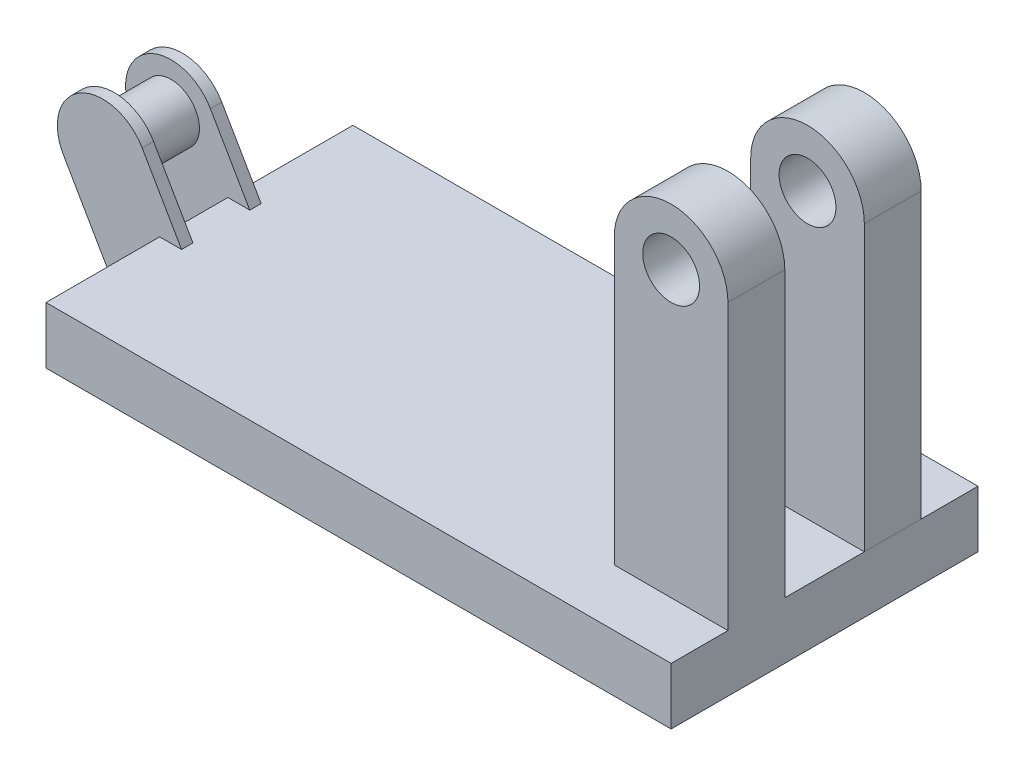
ISO-10303-21;
HEADER;
FILE_DESCRIPTION(('STEP AP214'),'2;1');
FILE_NAME('part.step','',(''),(''),'','','');
FILE_SCHEMA(('AUTOMOTIVE_DESIGN { 1 0 10303 214 1 1 1 1 }'));
ENDSEC;
DATA;
#1=APPLICATION_CONTEXT('core data for automotive mechanical design processes');
#2=APPLICATION_PROTOCOL_DEFINITION('international standard','automotive_design',2000,#1);
#3=PRODUCT_CONTEXT('',#1,'mechanical');
#4=PRODUCT('Part','Part','',(#3));
#5=PRODUCT_RELATED_PRODUCT_CATEGORY('part','',(#4));
#6=PRODUCT_DEFINITION_FORMATION('','',#4);
#7=PRODUCT_DEFINITION_CONTEXT('part definition',#1,'design');
#8=PRODUCT_DEFINITION('design','',#6,#7);
#9=PRODUCT_DEFINITION_SHAPE('','',#8);
#10=(LENGTH_UNIT() NAMED_UNIT(*) SI_UNIT(.MILLI.,.METRE.));
#11=(NAMED_UNIT(*) PLANE_ANGLE_UNIT() SI_UNIT($,.RADIAN.));
#12=(NAMED_UNIT(*) SI_UNIT($,.STERADIAN.) SOLID_ANGLE_UNIT());
#13=UNCERTAINTY_MEASURE_WITH_UNIT(LENGTH_MEASURE(1.E-05),#10,'distance_accuracy_value','');
#14=(GEOMETRIC_REPRESENTATION_CONTEXT(3) GLOBAL_UNCERTAINTY_ASSIGNED_CONTEXT((#13)) GLOBAL_UNIT_ASSIGNED_CONTEXT((#10,
#11,#12)) REPRESENTATION_CONTEXT('',''));
#15=CARTESIAN_POINT('',(0.,0.,0.));
#16=DIRECTION('',(0.,0.,1.));
#17=DIRECTION('',(1.,0.,0.));
#18=AXIS2_PLACEMENT_3D('',#15,#16,#17);
#19=CARTESIAN_POINT('',(225.,300.,-85.));
#20=DIRECTION('',(0.,0.,-1.));
#21=DIRECTION('',(1.,0.,0.));
#22=AXIS2_PLACEMENT_3D('',#19,#20,#21);
#23=PLANE('',#22);
#24=DIRECTION('',(1.,0.,0.));
#25=VECTOR('',#24,1.);
#26=CARTESIAN_POINT('',(275.,50.,-85.));
#27=LINE('',#26,#25);
#28=CARTESIAN_POINT('',(175.,50.,-85.));
#29=VERTEX_POINT('',#28);
#30=CARTESIAN_POINT('',(275.,50.,-85.));
#31=VERTEX_POINT('',#30);
#32=EDGE_CURVE('E96',#29,#31,#27,.T.);
#33=ORIENTED_EDGE('',*,*,#32,.F.);
#34=DIRECTION('',(0.,-1.,0.));
#35=VECTOR('',#34,1.);
#36=CARTESIAN_POINT('',(175.,50.,-85.));
#37=LINE('',#36,#35);
#38=CARTESIAN_POINT('',(175.,300.,-85.));
#39=VERTEX_POINT('',#38);
#40=EDGE_CURVE('E99',#39,#29,#37,.T.);
#41=ORIENTED_EDGE('',*,*,#40,.F.);
#42=CARTESIAN_POINT('',(225.,300.,-85.));
#43=DIRECTION('',(0.,0.,1.));
#44=DIRECTION('',(1.,0.,0.));
#45=AXIS2_PLACEMENT_3D('',#42,#43,#44);
#46=CIRCLE('',#45,50.);
#47=CARTESIAN_POINT('',(275.,300.,-85.));
#48=VERTEX_POINT('',#47);
#49=EDGE_CURVE('E87',#48,#39,#46,.T.);
#50=ORIENTED_EDGE('',*,*,#49,.F.);
#51=DIRECTION('',(0.,1.,0.));
#52=VECTOR('',#51,1.);
#53=CARTESIAN_POINT('',(275.,300.,-85.));
#54=LINE('',#53,#52);
#55=EDGE_CURVE('E92',#31,#48,#54,.T.);
#56=ORIENTED_EDGE('',*,*,#55,.F.);
#57=EDGE_LOOP('',(#33,#41,#50,#56));
#58=FACE_BOUND('',#57,.T.);
#59=CARTESIAN_POINT('',(225.,300.,-85.));
#60=DIRECTION('',(0.,0.,1.));
#61=DIRECTION('',(1.,0.,0.));
#62=AXIS2_PLACEMENT_3D('',#59,#60,#61);
#63=CIRCLE('',#62,25.);
#64=CARTESIAN_POINT('',(250.,300.,-85.));
#65=VERTEX_POINT('',#64);
#66=EDGE_CURVE('E108',#65,#65,#63,.T.);
#67=ORIENTED_EDGE('',*,*,#66,.T.);
#68=EDGE_LOOP('',(#67));
#69=FACE_BOUND('',#68,.T.);
#70=ADVANCED_FACE('F40',(#58,#69),#23,.T.);
#71=CARTESIAN_POINT('',(225.,300.,-35.));
#72=DIRECTION('',(0.,0.,-1.));
#73=DIRECTION('',(1.,0.,0.));
#74=AXIS2_PLACEMENT_3D('',#71,#72,#73);
#75=PLANE('',#74);
#76=DIRECTION('',(1.,0.,0.));
#77=VECTOR('',#76,1.);
#78=CARTESIAN_POINT('',(275.,50.,-35.));
#79=LINE('',#78,#77);
#80=CARTESIAN_POINT('',(175.,50.,-35.));
#81=VERTEX_POINT('',#80);
#82=CARTESIAN_POINT('',(275.,50.,-35.));
#83=VERTEX_POINT('',#82);
#84=EDGE_CURVE('E104',#81,#83,#79,.T.);
#85=ORIENTED_EDGE('',*,*,#84,.T.);
#86=DIRECTION('',(0.,1.,0.));
#87=VECTOR('',#86,1.);
#88=CARTESIAN_POINT('',(275.,300.,-35.));
#89=LINE('',#88,#87);
#90=CARTESIAN_POINT('',(275.,300.,-35.));
#91=VERTEX_POINT('',#90);
#92=EDGE_CURVE('E107',#83,#91,#89,.T.);
#93=ORIENTED_EDGE('',*,*,#92,.T.);
#94=CARTESIAN_POINT('',(225.,300.,-35.));
#95=DIRECTION('',(0.,0.,1.));
#96=DIRECTION('',(1.,0.,0.));
#97=AXIS2_PLACEMENT_3D('',#94,#95,#96);
#98=CIRCLE('',#97,50.);
#99=CARTESIAN_POINT('',(175.,300.,-35.));
#100=VERTEX_POINT('',#99);
#101=EDGE_CURVE('E90',#91,#100,#98,.T.);
#102=ORIENTED_EDGE('',*,*,#101,.T.);
#103=DIRECTION('',(0.,-1.,0.));
#104=VECTOR('',#103,1.);
#105=CARTESIAN_POINT('',(175.,50.,-35.));
#106=LINE('',#105,#104);
#107=EDGE_CURVE('E111',#100,#81,#106,.T.);
#108=ORIENTED_EDGE('',*,*,#107,.T.);
#109=EDGE_LOOP('',(#85,#93,#102,#108));
#110=FACE_BOUND('',#109,.T.);
#111=CARTESIAN_POINT('',(225.,300.,-35.));
#112=DIRECTION('',(0.,0.,1.));
#113=DIRECTION('',(1.,0.,0.));
#114=AXIS2_PLACEMENT_3D('',#111,#112,#113);
#115=CIRCLE('',#114,25.);
#116=CARTESIAN_POINT('',(250.,300.,-35.));
#117=VERTEX_POINT('',#116);
#118=EDGE_CURVE('E116',#117,#117,#115,.T.);
#119=ORIENTED_EDGE('',*,*,#118,.F.);
#120=EDGE_LOOP('',(#119));
#121=FACE_BOUND('',#120,.T.);
#122=ADVANCED_FACE('F129',(#110,#121),#75,.F.);
#123=CARTESIAN_POINT('',(275.,50.,-85.));
#124=DIRECTION('',(0.,1.,0.));
#125=DIRECTION('',(0.,0.,-1.));
#126=AXIS2_PLACEMENT_3D('',#123,#124,#125);
#127=PLANE('',#126);
#128=ORIENTED_EDGE('',*,*,#84,.F.);
#129=DIRECTION('',(0.,0.,1.));
#130=VECTOR('',#129,1.);
#131=CARTESIAN_POINT('',(175.,50.,-85.));
#132=LINE('',#131,#130);
#133=EDGE_CURVE('E57',#29,#81,#132,.T.);
#134=ORIENTED_EDGE('',*,*,#133,.F.);
#135=ORIENTED_EDGE('',*,*,#32,.T.);
#136=DIRECTION('',(0.,0.,1.));
#137=VECTOR('',#136,1.);
#138=CARTESIAN_POINT('',(275.,50.,-85.));
#139=LINE('',#138,#137);
#140=EDGE_CURVE('E12',#31,#83,#139,.T.);
#141=ORIENTED_EDGE('',*,*,#140,.T.);
#142=EDGE_LOOP('',(#128,#134,#135,#141));
#143=FACE_BOUND('',#142,.T.);
#144=ADVANCED_FACE('F42',(#143),#127,.F.);
#145=CARTESIAN_POINT('',(275.,300.,-85.));
#146=DIRECTION('',(-1.,0.,0.));
#147=DIRECTION('',(0.,-1.,0.));
#148=AXIS2_PLACEMENT_3D('',#145,#146,#147);
#149=PLANE('',#148);
#150=ORIENTED_EDGE('',*,*,#92,.F.);
#151=ORIENTED_EDGE('',*,*,#140,.F.);
#152=ORIENTED_EDGE('',*,*,#55,.T.);
#153=DIRECTION('',(0.,0.,1.));
#154=VECTOR('',#153,1.);
#155=CARTESIAN_POINT('',(275.,300.,-85.));
#156=LINE('',#155,#154);
#157=EDGE_CURVE('E49',#48,#91,#156,.T.);
#158=ORIENTED_EDGE('',*,*,#157,.T.);
#159=EDGE_LOOP('',(#150,#151,#152,#158));
#160=FACE_BOUND('',#159,.T.);
#161=ADVANCED_FACE('F93',(#160),#149,.F.);
#162=CARTESIAN_POINT('',(225.,300.,-85.));
#163=DIRECTION('',(0.,0.,1.));
#164=DIRECTION('',(-1.,0.,0.));
#165=AXIS2_PLACEMENT_3D('',#162,#163,#164);
#166=CYLINDRICAL_SURFACE('',#165,50.);
#167=ORIENTED_EDGE('',*,*,#101,.F.);
#168=ORIENTED_EDGE('',*,*,#157,.F.);
#169=ORIENTED_EDGE('',*,*,#49,.T.);
#170=DIRECTION('',(0.,0.,1.));
#171=VECTOR('',#170,1.);
#172=CARTESIAN_POINT('',(175.,300.,-85.));
#173=LINE('',#172,#171);
#174=EDGE_CURVE('E73',#39,#100,#173,.T.);
#175=ORIENTED_EDGE('',*,*,#174,.T.);
#176=EDGE_LOOP('',(#167,#168,#169,#175));
#177=FACE_BOUND('',#176,.T.);
#178=ADVANCED_FACE('F85',(#177),#166,.T.);
#179=CARTESIAN_POINT('',(175.,50.,-85.));
#180=DIRECTION('',(1.,0.,0.));
#181=DIRECTION('',(0.,0.,1.));
#182=AXIS2_PLACEMENT_3D('',#179,#180,#181);
#183=PLANE('',#182);
#184=ORIENTED_EDGE('',*,*,#107,.F.);
#185=ORIENTED_EDGE('',*,*,#174,.F.);
#186=ORIENTED_EDGE('',*,*,#40,.T.);
#187=ORIENTED_EDGE('',*,*,#133,.T.);
#188=EDGE_LOOP('',(#184,#185,#186,#187));
#189=FACE_BOUND('',#188,.T.);
#190=ADVANCED_FACE('F125',(#189),#183,.F.);
#191=CARTESIAN_POINT('',(225.,300.,-85.));
#192=DIRECTION('',(0.,0.,1.));
#193=DIRECTION('',(-1.,0.,0.));
#194=AXIS2_PLACEMENT_3D('',#191,#192,#193);
#195=CYLINDRICAL_SURFACE('',#194,25.);
#196=ORIENTED_EDGE('',*,*,#66,.F.);
#197=EDGE_LOOP('',(#196));
#198=FACE_BOUND('',#197,.T.);
#199=ORIENTED_EDGE('',*,*,#118,.T.);
#200=EDGE_LOOP('',(#199));
#201=FACE_BOUND('',#200,.T.);
#202=ADVANCED_FACE('F122',(#198,#201),#195,.F.);
#203=CLOSED_SHELL('',(#70,#122,#144,#161,#178,#190,#202));
#204=MANIFOLD_SOLID_BREP('B2',#203);
#205=CARTESIAN_POINT('',(-275.,50.,-135.));
#206=DIRECTION('',(1.,0.,0.));
#207=DIRECTION('',(0.,0.,-1.));
#208=AXIS2_PLACEMENT_3D('',#205,#206,#207);
#209=PLANE('',#208);
#210=DIRECTION('',(0.,1.,0.));
#211=VECTOR('',#210,1.);
#212=CARTESIAN_POINT('',(-275.,50.,-25.));
#213=LINE('',#212,#211);
#214=CARTESIAN_POINT('',(-275.,0.,-25.));
#215=VERTEX_POINT('',#214);
#216=CARTESIAN_POINT('',(-275.,50.,-25.));
#217=VERTEX_POINT('',#216);
#218=EDGE_CURVE('E199',#215,#217,#213,.T.);
#219=ORIENTED_EDGE('',*,*,#218,.F.);
#220=DIRECTION('',(0.,0.,1.));
#221=VECTOR('',#220,1.);
#222=CARTESIAN_POINT('',(-275.,0.,-135.));
#223=LINE('',#222,#221);
#224=CARTESIAN_POINT('',(-275.,0.,25.));
#225=VERTEX_POINT('',#224);
#226=EDGE_CURVE('E468',#215,#225,#223,.T.);
#227=ORIENTED_EDGE('',*,*,#226,.T.);
#228=DIRECTION('',(0.,-1.,0.));
#229=VECTOR('',#228,1.);
#230=CARTESIAN_POINT('',(-275.,50.,25.));
#231=LINE('',#230,#229);
#232=CARTESIAN_POINT('',(-275.,50.,25.));
#233=VERTEX_POINT('',#232);
#234=EDGE_CURVE('E442',#233,#225,#231,.T.);
#235=ORIENTED_EDGE('',*,*,#234,.F.);
#236=DIRECTION('',(0.,0.,1.));
#237=VECTOR('',#236,1.);
#238=CARTESIAN_POINT('',(-275.,50.,-135.));
#239=LINE('',#238,#237);
#240=EDGE_CURVE('E455',#217,#233,#239,.T.);
#241=ORIENTED_EDGE('',*,*,#240,.F.);
#242=EDGE_LOOP('',(#219,#227,#235,#241));
#243=FACE_BOUND('',#242,.T.);
#244=ADVANCED_FACE('F184',(#243),#209,.F.);
#245=CARTESIAN_POINT('',(-325.,90.,25.));
#246=DIRECTION('',(0.,0.,1.));
#247=DIRECTION('',(1.,0.,0.));
#248=AXIS2_PLACEMENT_3D('',#245,#246,#247);
#249=PLANE('',#248);
#250=DIRECTION('',(1.,0.,0.));
#251=VECTOR('',#250,1.);
#252=CARTESIAN_POINT('',(-275.,50.,25.));
#253=LINE('',#252,#251);
#254=CARTESIAN_POINT('',(-255.717967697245,50.,25.));
#255=VERTEX_POINT('',#254);
#256=EDGE_CURVE('E439',#233,#255,#253,.T.);
#257=ORIENTED_EDGE('',*,*,#256,.F.);
#258=ORIENTED_EDGE('',*,*,#234,.T.);
#259=DIRECTION('',(1.,0.,0.));
#260=VECTOR('',#259,1.);
#261=CARTESIAN_POINT('',(-275.,0.,25.));
#262=LINE('',#261,#260);
#263=CARTESIAN_POINT('',(-319.210884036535,0.,25.));
#264=VERTEX_POINT('',#263);
#265=EDGE_CURVE('E413',#264,#225,#262,.T.);
#266=ORIENTED_EDGE('',*,*,#265,.F.);
#267=DIRECTION('',(0.499999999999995,-0.866025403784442,0.));
#268=VECTOR('',#267,1.);
#269=CARTESIAN_POINT('',(-319.210884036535,0.,25.));
#270=LINE('',#269,#268);
#271=CARTESIAN_POINT('',(-359.109321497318,69.1061208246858,25.));
#272=VERTEX_POINT('',#271);
#273=EDGE_CURVE('E424',#272,#264,#270,.T.);
#274=ORIENTED_EDGE('',*,*,#273,.F.);
#275=CARTESIAN_POINT('',(-325.,90.,25.));
#276=DIRECTION('',(0.,0.,1.));
#277=DIRECTION('',(1.,0.,0.));
#278=AXIS2_PLACEMENT_3D('',#275,#276,#277);
#279=CIRCLE('',#278,40.);
#280=CARTESIAN_POINT('',(-290.358983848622,110.,25.));
#281=VERTEX_POINT('',#280);
#282=EDGE_CURVE('E422',#281,#272,#279,.T.);
#283=ORIENTED_EDGE('',*,*,#282,.F.);
#284=DIRECTION('',(-0.499999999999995,0.866025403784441,0.));
#285=VECTOR('',#284,1.);
#286=CARTESIAN_POINT('',(-290.358983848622,110.,25.));
#287=LINE('',#286,#285);
#288=EDGE_CURVE('E409',#255,#281,#287,.T.);
#289=ORIENTED_EDGE('',*,*,#288,.F.);
#290=EDGE_LOOP('',(#257,#258,#266,#274,#283,#289));
#291=FACE_BOUND('',#290,.T.);
#292=CARTESIAN_POINT('',(-325.,90.,25.));
#293=DIRECTION('',(0.,0.,1.));
#294=DIRECTION('',(1.,0.,0.));
#295=AXIS2_PLACEMENT_3D('',#292,#293,#294);
#296=CIRCLE('',#295,25.);
#297=CARTESIAN_POINT('',(-300.,90.,25.));
#298=VERTEX_POINT('',#297);
#299=EDGE_CURVE('E38',#298,#298,#296,.F.);
#300=ORIENTED_EDGE('',*,*,#299,.F.);
#301=EDGE_LOOP('',(#300));
#302=FACE_BOUND('',#301,.T.);
#303=ADVANCED_FACE('F540',(#291,#302),#249,.F.);
#304=CARTESIAN_POINT('',(-275.,0.,-135.));
#305=VERTEX_POINT('',#304);
#306=CARTESIAN_POINT('',(-275.,0.,-35.));
#307=VERTEX_POINT('',#306);
#308=EDGE_CURVE('E465',#305,#307,#223,.T.);
#309=ORIENTED_EDGE('',*,*,#308,.T.);
#310=DIRECTION('',(0.,1.,0.));
#311=VECTOR('',#310,1.);
#312=CARTESIAN_POINT('',(-275.,50.,-35.));
#313=LINE('',#312,#311);
#314=CARTESIAN_POINT('',(-275.,50.,-35.));
#315=VERTEX_POINT('',#314);
#316=EDGE_CURVE('E330',#307,#315,#313,.T.);
#317=ORIENTED_EDGE('',*,*,#316,.T.);
#318=CARTESIAN_POINT('',(-275.,50.,-135.));
#319=VERTEX_POINT('',#318);
#320=EDGE_CURVE('E451',#319,#315,#239,.T.);
#321=ORIENTED_EDGE('',*,*,#320,.F.);
#322=DIRECTION('',(0.,-1.,0.));
#323=VECTOR('',#322,1.);
#324=CARTESIAN_POINT('',(-275.,50.,-135.));
#325=LINE('',#324,#323);
#326=EDGE_CURVE('E464',#319,#305,#325,.T.);
#327=ORIENTED_EDGE('',*,*,#326,.T.);
#328=EDGE_LOOP('',(#309,#317,#321,#327));
#329=FACE_BOUND('',#328,.T.);
#330=ADVANCED_FACE('F542',(#329),#209,.F.);
#331=CARTESIAN_POINT('',(-275.,50.,35.));
#332=VERTEX_POINT('',#331);
#333=CARTESIAN_POINT('',(-275.,50.,135.));
#334=VERTEX_POINT('',#333);
#335=EDGE_CURVE('E456',#332,#334,#239,.T.);
#336=ORIENTED_EDGE('',*,*,#335,.F.);
#337=DIRECTION('',(0.,-1.,0.));
#338=VECTOR('',#337,1.);
#339=CARTESIAN_POINT('',(-275.,50.,35.));
#340=LINE('',#339,#338);
#341=CARTESIAN_POINT('',(-275.,0.,35.));
#342=VERTEX_POINT('',#341);
#343=EDGE_CURVE('E447',#332,#342,#340,.T.);
#344=ORIENTED_EDGE('',*,*,#343,.T.);
#345=CARTESIAN_POINT('',(-275.,0.,135.));
#346=VERTEX_POINT('',#345);
#347=EDGE_CURVE('E450',#342,#346,#223,.T.);
#348=ORIENTED_EDGE('',*,*,#347,.T.);
#349=DIRECTION('',(0.,-1.,0.));
#350=VECTOR('',#349,1.);
#351=CARTESIAN_POINT('',(-275.,50.,135.));
#352=LINE('',#351,#350);
#353=EDGE_CURVE('E192',#334,#346,#352,.T.);
#354=ORIENTED_EDGE('',*,*,#353,.F.);
#355=EDGE_LOOP('',(#336,#344,#348,#354));
#356=FACE_BOUND('',#355,.T.);
#357=ADVANCED_FACE('F186',(#356),#209,.F.);
#358=CARTESIAN_POINT('',(-275.,50.,135.));
#359=DIRECTION('',(0.,0.,-1.));
#360=DIRECTION('',(-1.,0.,0.));
#361=AXIS2_PLACEMENT_3D('',#358,#359,#360);
#362=PLANE('',#361);
#363=DIRECTION('',(1.,0.,0.));
#364=VECTOR('',#363,1.);
#365=CARTESIAN_POINT('',(-275.,0.,135.));
#366=LINE('',#365,#364);
#367=CARTESIAN_POINT('',(275.,0.,135.));
#368=VERTEX_POINT('',#367);
#369=EDGE_CURVE('E467',#346,#368,#366,.T.);
#370=ORIENTED_EDGE('',*,*,#369,.T.);
#371=DIRECTION('',(0.,-1.,0.));
#372=VECTOR('',#371,1.);
#373=CARTESIAN_POINT('',(275.,50.,135.));
#374=LINE('',#373,#372);
#375=CARTESIAN_POINT('',(275.,50.,135.));
#376=VERTEX_POINT('',#375);
#377=EDGE_CURVE('E479',#376,#368,#374,.T.);
#378=ORIENTED_EDGE('',*,*,#377,.F.);
#379=DIRECTION('',(1.,0.,0.));
#380=VECTOR('',#379,1.);
#381=CARTESIAN_POINT('',(-275.,50.,135.));
#382=LINE('',#381,#380);
#383=EDGE_CURVE('E454',#334,#376,#382,.T.);
#384=ORIENTED_EDGE('',*,*,#383,.F.);
#385=ORIENTED_EDGE('',*,*,#353,.T.);
#386=EDGE_LOOP('',(#370,#378,#384,#385));
#387=FACE_BOUND('',#386,.T.);
#388=ADVANCED_FACE('F485',(#387),#362,.F.);
#389=CARTESIAN_POINT('',(275.,50.,-135.));
#390=DIRECTION('',(-1.,0.,0.));
#391=DIRECTION('',(0.,0.,1.));
#392=AXIS2_PLACEMENT_3D('',#389,#390,#391);
#393=PLANE('',#392);
#394=DIRECTION('',(0.,-1.,0.));
#395=VECTOR('',#394,1.);
#396=CARTESIAN_POINT('',(275.,50.,-135.));
#397=LINE('',#396,#395);
#398=CARTESIAN_POINT('',(275.,50.,-135.));
#399=VERTEX_POINT('',#398);
#400=CARTESIAN_POINT('',(275.,0.,-135.));
#401=VERTEX_POINT('',#400);
#402=EDGE_CURVE('E476',#399,#401,#397,.T.);
#403=ORIENTED_EDGE('',*,*,#402,.F.);
#404=DIRECTION('',(0.,0.,-1.));
#405=VECTOR('',#404,1.);
#406=CARTESIAN_POINT('',(275.,50.,-135.));
#407=LINE('',#406,#405);
#408=CARTESIAN_POINT('',(275.,50.,35.));
#409=VERTEX_POINT('',#408);
#410=EDGE_CURVE('E458',#409,#399,#407,.T.);
#411=ORIENTED_EDGE('',*,*,#410,.F.);
#412=DIRECTION('',(0.,1.,0.));
#413=VECTOR('',#412,1.);
#414=CARTESIAN_POINT('',(275.,300.,35.));
#415=LINE('',#414,#413);
#416=CARTESIAN_POINT('',(275.,300.,35.));
#417=VERTEX_POINT('',#416);
#418=EDGE_CURVE('E396',#409,#417,#415,.T.);
#419=ORIENTED_EDGE('',*,*,#418,.T.);
#420=DIRECTION('',(0.,0.,-1.));
#421=VECTOR('',#420,1.);
#422=CARTESIAN_POINT('',(275.,300.,85.));
#423=LINE('',#422,#421);
#424=CARTESIAN_POINT('',(275.,300.,85.));
#425=VERTEX_POINT('',#424);
#426=EDGE_CURVE('E406',#425,#417,#423,.T.);
#427=ORIENTED_EDGE('',*,*,#426,.F.);
#428=DIRECTION('',(0.,1.,0.));
#429=VECTOR('',#428,1.);
#430=CARTESIAN_POINT('',(275.,300.,85.));
#431=LINE('',#430,#429);
#432=CARTESIAN_POINT('',(275.,50.,85.));
#433=VERTEX_POINT('',#432);
#434=EDGE_CURVE('E387',#433,#425,#431,.T.);
#435=ORIENTED_EDGE('',*,*,#434,.F.);
#436=EDGE_CURVE('E459',#376,#433,#407,.T.);
#437=ORIENTED_EDGE('',*,*,#436,.F.);
#438=ORIENTED_EDGE('',*,*,#377,.T.);
#439=DIRECTION('',(0.,0.,-1.));
#440=VECTOR('',#439,1.);
#441=CARTESIAN_POINT('',(275.,0.,-135.));
#442=LINE('',#441,#440);
#443=EDGE_CURVE('E470',#368,#401,#442,.T.);
#444=ORIENTED_EDGE('',*,*,#443,.T.);
#445=EDGE_LOOP('',(#403,#411,#419,#427,#435,#437,#438,#444));
#446=FACE_BOUND('',#445,.T.);
#447=ADVANCED_FACE('F494',(#446),#393,.F.);
#448=CARTESIAN_POINT('',(-275.,50.,-135.));
#449=DIRECTION('',(0.,0.,1.));
#450=DIRECTION('',(1.,0.,0.));
#451=AXIS2_PLACEMENT_3D('',#448,#449,#450);
#452=PLANE('',#451);
#453=DIRECTION('',(-1.,0.,0.));
#454=VECTOR('',#453,1.);
#455=CARTESIAN_POINT('',(-275.,0.,-135.));
#456=LINE('',#455,#454);
#457=EDGE_CURVE('E472',#401,#305,#456,.T.);
#458=ORIENTED_EDGE('',*,*,#457,.T.);
#459=ORIENTED_EDGE('',*,*,#326,.F.);
#460=DIRECTION('',(-1.,0.,0.));
#461=VECTOR('',#460,1.);
#462=CARTESIAN_POINT('',(-275.,50.,-135.));
#463=LINE('',#462,#461);
#464=EDGE_CURVE('E462',#399,#319,#463,.T.);
#465=ORIENTED_EDGE('',*,*,#464,.F.);
#466=ORIENTED_EDGE('',*,*,#402,.T.);
#467=EDGE_LOOP('',(#458,#459,#465,#466));
#468=FACE_BOUND('',#467,.T.);
#469=ADVANCED_FACE('F499',(#468),#452,.F.);
#470=CARTESIAN_POINT('',(-275.,50.,135.));
#471=DIRECTION('',(0.,1.,0.));
#472=DIRECTION('',(0.,0.,1.));
#473=AXIS2_PLACEMENT_3D('',#470,#471,#472);
#474=PLANE('',#473);
#475=DIRECTION('',(-1.,0.,0.));
#476=VECTOR('',#475,1.);
#477=CARTESIAN_POINT('',(-275.,50.,-35.));
#478=LINE('',#477,#476);
#479=CARTESIAN_POINT('',(-255.717967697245,50.,-35.));
#480=VERTEX_POINT('',#479);
#481=EDGE_CURVE('E375',#480,#315,#478,.T.);
#482=ORIENTED_EDGE('',*,*,#481,.F.);
#483=DIRECTION('',(0.,0.,1.));
#484=VECTOR('',#483,1.);
#485=CARTESIAN_POINT('',(-255.717967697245,50.,-35.));
#486=LINE('',#485,#484);
#487=CARTESIAN_POINT('',(-255.717967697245,50.,-25.));
#488=VERTEX_POINT('',#487);
#489=EDGE_CURVE('E356',#480,#488,#486,.T.);
#490=ORIENTED_EDGE('',*,*,#489,.T.);
#491=DIRECTION('',(-1.,0.,0.));
#492=VECTOR('',#491,1.);
#493=CARTESIAN_POINT('',(-275.,50.,-25.));
#494=LINE('',#493,#492);
#495=EDGE_CURVE('E372',#488,#217,#494,.T.);
#496=ORIENTED_EDGE('',*,*,#495,.T.);
#497=ORIENTED_EDGE('',*,*,#240,.T.);
#498=ORIENTED_EDGE('',*,*,#256,.T.);
#499=DIRECTION('',(0.,0.,-1.));
#500=VECTOR('',#499,1.);
#501=CARTESIAN_POINT('',(-255.717967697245,50.,35.));
#502=LINE('',#501,#500);
#503=CARTESIAN_POINT('',(-255.717967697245,50.,35.));
#504=VERTEX_POINT('',#503);
#505=EDGE_CURVE('E436',#504,#255,#502,.T.);
#506=ORIENTED_EDGE('',*,*,#505,.F.);
#507=DIRECTION('',(1.,0.,0.));
#508=VECTOR('',#507,1.);
#509=CARTESIAN_POINT('',(-275.,50.,35.));
#510=LINE('',#509,#508);
#511=EDGE_CURVE('E445',#332,#504,#510,.T.);
#512=ORIENTED_EDGE('',*,*,#511,.F.);
#513=ORIENTED_EDGE('',*,*,#335,.T.);
#514=ORIENTED_EDGE('',*,*,#383,.T.);
#515=ORIENTED_EDGE('',*,*,#436,.T.);
#516=DIRECTION('',(1.,0.,0.));
#517=VECTOR('',#516,1.);
#518=CARTESIAN_POINT('',(275.,50.,85.));
#519=LINE('',#518,#517);
#520=CARTESIAN_POINT('',(175.,50.,85.));
#521=VERTEX_POINT('',#520);
#522=EDGE_CURVE('E384',#521,#433,#519,.T.);
#523=ORIENTED_EDGE('',*,*,#522,.F.);
#524=DIRECTION('',(0.,0.,-1.));
#525=VECTOR('',#524,1.);
#526=CARTESIAN_POINT('',(175.,50.,85.));
#527=LINE('',#526,#525);
#528=CARTESIAN_POINT('',(175.,50.,35.));
#529=VERTEX_POINT('',#528);
#530=EDGE_CURVE('E394',#521,#529,#527,.T.);
#531=ORIENTED_EDGE('',*,*,#530,.T.);
#532=DIRECTION('',(1.,0.,0.));
#533=VECTOR('',#532,1.);
#534=CARTESIAN_POINT('',(275.,50.,35.));
#535=LINE('',#534,#533);
#536=EDGE_CURVE('E207',#529,#409,#535,.T.);
#537=ORIENTED_EDGE('',*,*,#536,.T.);
#538=ORIENTED_EDGE('',*,*,#410,.T.);
#539=ORIENTED_EDGE('',*,*,#464,.T.);
#540=ORIENTED_EDGE('',*,*,#320,.T.);
#541=EDGE_LOOP('',(#482,#490,#496,#497,#498,#506,#512,#513,#514,#515,#523,#531,#537,#538,#539,#540));
#542=FACE_BOUND('',#541,.T.);
#543=ADVANCED_FACE('F504',(#542),#474,.T.);
#544=CARTESIAN_POINT('',(-275.,0.,135.));
#545=DIRECTION('',(0.,1.,0.));
#546=DIRECTION('',(0.,0.,1.));
#547=AXIS2_PLACEMENT_3D('',#544,#545,#546);
#548=PLANE('',#547);
#549=ORIENTED_EDGE('',*,*,#457,.F.);
#550=ORIENTED_EDGE('',*,*,#443,.F.);
#551=ORIENTED_EDGE('',*,*,#369,.F.);
#552=ORIENTED_EDGE('',*,*,#347,.F.);
#553=DIRECTION('',(1.,0.,0.));
#554=VECTOR('',#553,1.);
#555=CARTESIAN_POINT('',(-275.,0.,35.));
#556=LINE('',#555,#554);
#557=CARTESIAN_POINT('',(-319.210884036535,0.,35.));
#558=VERTEX_POINT('',#557);
#559=EDGE_CURVE('E410',#558,#342,#556,.T.);
#560=ORIENTED_EDGE('',*,*,#559,.F.);
#561=DIRECTION('',(0.,0.,-1.));
#562=VECTOR('',#561,1.);
#563=CARTESIAN_POINT('',(-319.210884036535,0.,35.));
#564=LINE('',#563,#562);
#565=EDGE_CURVE('E420',#558,#264,#564,.T.);
#566=ORIENTED_EDGE('',*,*,#565,.T.);
#567=ORIENTED_EDGE('',*,*,#265,.T.);
#568=ORIENTED_EDGE('',*,*,#226,.F.);
#569=DIRECTION('',(1.,0.,0.));
#570=VECTOR('',#569,1.);
#571=CARTESIAN_POINT('',(-275.,0.,-25.));
#572=LINE('',#571,#570);
#573=CARTESIAN_POINT('',(-319.210884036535,0.,-25.));
#574=VERTEX_POINT('',#573);
#575=EDGE_CURVE('E341',#574,#215,#572,.T.);
#576=ORIENTED_EDGE('',*,*,#575,.F.);
#577=DIRECTION('',(0.,0.,1.));
#578=VECTOR('',#577,1.);
#579=CARTESIAN_POINT('',(-319.210884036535,0.,-35.));
#580=LINE('',#579,#578);
#581=CARTESIAN_POINT('',(-319.210884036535,0.,-35.));
#582=VERTEX_POINT('',#581);
#583=EDGE_CURVE('E337',#582,#574,#580,.T.);
#584=ORIENTED_EDGE('',*,*,#583,.F.);
#585=DIRECTION('',(1.,0.,0.));
#586=VECTOR('',#585,1.);
#587=CARTESIAN_POINT('',(-275.,0.,-35.));
#588=LINE('',#587,#586);
#589=EDGE_CURVE('E322',#582,#307,#588,.T.);
#590=ORIENTED_EDGE('',*,*,#589,.T.);
#591=ORIENTED_EDGE('',*,*,#308,.F.);
#592=EDGE_LOOP('',(#549,#550,#551,#552,#560,#566,#567,#568,#576,#584,#590,#591));
#593=FACE_BOUND('',#592,.T.);
#594=ADVANCED_FACE('F339',(#593),#548,.F.);
#595=CARTESIAN_POINT('',(-325.,90.,35.));
#596=DIRECTION('',(0.,0.,1.));
#597=DIRECTION('',(1.,0.,0.));
#598=AXIS2_PLACEMENT_3D('',#595,#596,#597);
#599=PLANE('',#598);
#600=ORIENTED_EDGE('',*,*,#343,.F.);
#601=ORIENTED_EDGE('',*,*,#511,.T.);
#602=DIRECTION('',(-0.499999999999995,0.866025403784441,0.));
#603=VECTOR('',#602,1.);
#604=CARTESIAN_POINT('',(-290.358983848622,110.,35.));
#605=LINE('',#604,#603);
#606=CARTESIAN_POINT('',(-290.358983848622,110.,35.));
#607=VERTEX_POINT('',#606);
#608=EDGE_CURVE('E412',#504,#607,#605,.T.);
#609=ORIENTED_EDGE('',*,*,#608,.T.);
#610=CARTESIAN_POINT('',(-325.,90.,35.));
#611=DIRECTION('',(0.,0.,1.));
#612=DIRECTION('',(1.,0.,0.));
#613=AXIS2_PLACEMENT_3D('',#610,#611,#612);
#614=CIRCLE('',#613,40.);
#615=CARTESIAN_POINT('',(-359.109321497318,69.1061208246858,35.));
#616=VERTEX_POINT('',#615);
#617=EDGE_CURVE('E415',#607,#616,#614,.T.);
#618=ORIENTED_EDGE('',*,*,#617,.T.);
#619=DIRECTION('',(0.499999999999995,-0.866025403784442,0.));
#620=VECTOR('',#619,1.);
#621=CARTESIAN_POINT('',(-319.210884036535,0.,35.));
#622=LINE('',#621,#620);
#623=EDGE_CURVE('E417',#616,#558,#622,.T.);
#624=ORIENTED_EDGE('',*,*,#623,.T.);
#625=ORIENTED_EDGE('',*,*,#559,.T.);
#626=EDGE_LOOP('',(#600,#601,#609,#618,#624,#625));
#627=FACE_BOUND('',#626,.T.);
#628=ADVANCED_FACE('F563',(#627),#599,.T.);
#629=CARTESIAN_POINT('',(-290.358983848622,110.,35.));
#630=DIRECTION('',(-0.866025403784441,-0.499999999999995,0.));
#631=DIRECTION('',(0.499999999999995,-0.866025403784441,0.));
#632=AXIS2_PLACEMENT_3D('',#629,#630,#631);
#633=PLANE('',#632);
#634=ORIENTED_EDGE('',*,*,#288,.T.);
#635=DIRECTION('',(0.,0.,-1.));
#636=VECTOR('',#635,1.);
#637=CARTESIAN_POINT('',(-290.358983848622,110.,35.));
#638=LINE('',#637,#636);
#639=EDGE_CURVE('E433',#607,#281,#638,.T.);
#640=ORIENTED_EDGE('',*,*,#639,.F.);
#641=ORIENTED_EDGE('',*,*,#608,.F.);
#642=ORIENTED_EDGE('',*,*,#505,.T.);
#643=EDGE_LOOP('',(#634,#640,#641,#642));
#644=FACE_BOUND('',#643,.T.);
#645=ADVANCED_FACE('F566',(#644),#633,.F.);
#646=CARTESIAN_POINT('',(-325.,90.,35.));
#647=DIRECTION('',(0.,0.,-1.));
#648=DIRECTION('',(-1.,0.,0.));
#649=AXIS2_PLACEMENT_3D('',#646,#647,#648);
#650=CYLINDRICAL_SURFACE('',#649,40.);
#651=ORIENTED_EDGE('',*,*,#282,.T.);
#652=DIRECTION('',(0.,0.,-1.));
#653=VECTOR('',#652,1.);
#654=CARTESIAN_POINT('',(-359.109321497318,69.1061208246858,35.));
#655=LINE('',#654,#653);
#656=EDGE_CURVE('E430',#616,#272,#655,.T.);
#657=ORIENTED_EDGE('',*,*,#656,.F.);
#658=ORIENTED_EDGE('',*,*,#617,.F.);
#659=ORIENTED_EDGE('',*,*,#639,.T.);
#660=EDGE_LOOP('',(#651,#657,#658,#659));
#661=FACE_BOUND('',#660,.T.);
#662=ADVANCED_FACE('F569',(#661),#650,.T.);
#663=CARTESIAN_POINT('',(-319.210884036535,0.,35.));
#664=DIRECTION('',(0.866025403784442,0.499999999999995,0.));
#665=DIRECTION('',(-0.499999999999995,0.866025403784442,0.));
#666=AXIS2_PLACEMENT_3D('',#663,#664,#665);
#667=PLANE('',#666);
#668=ORIENTED_EDGE('',*,*,#273,.T.);
#669=ORIENTED_EDGE('',*,*,#565,.F.);
#670=ORIENTED_EDGE('',*,*,#623,.F.);
#671=ORIENTED_EDGE('',*,*,#656,.T.);
#672=EDGE_LOOP('',(#668,#669,#670,#671));
#673=FACE_BOUND('',#672,.T.);
#674=ADVANCED_FACE('F522',(#673),#667,.F.);
#675=CARTESIAN_POINT('',(225.,300.,85.));
#676=DIRECTION('',(0.,0.,1.));
#677=DIRECTION('',(1.,0.,0.));
#678=AXIS2_PLACEMENT_3D('',#675,#676,#677);
#679=PLANE('',#678);
#680=ORIENTED_EDGE('',*,*,#522,.T.);
#681=ORIENTED_EDGE('',*,*,#434,.T.);
#682=CARTESIAN_POINT('',(225.,300.,85.));
#683=DIRECTION('',(0.,0.,1.));
#684=DIRECTION('',(1.,0.,0.));
#685=AXIS2_PLACEMENT_3D('',#682,#683,#684);
#686=CIRCLE('',#685,50.);
#687=CARTESIAN_POINT('',(175.,300.,85.));
#688=VERTEX_POINT('',#687);
#689=EDGE_CURVE('E390',#425,#688,#686,.T.);
#690=ORIENTED_EDGE('',*,*,#689,.T.);
#691=DIRECTION('',(0.,-1.,0.));
#692=VECTOR('',#691,1.);
#693=CARTESIAN_POINT('',(175.,50.,85.));
#694=LINE('',#693,#692);
#695=EDGE_CURVE('E392',#688,#521,#694,.T.);
#696=ORIENTED_EDGE('',*,*,#695,.T.);
#697=EDGE_LOOP('',(#680,#681,#690,#696));
#698=FACE_BOUND('',#697,.T.);
#699=CARTESIAN_POINT('',(225.,300.,85.));
#700=DIRECTION('',(0.,0.,1.));
#701=DIRECTION('',(1.,0.,0.));
#702=AXIS2_PLACEMENT_3D('',#699,#700,#701);
#703=CIRCLE('',#702,25.);
#704=CARTESIAN_POINT('',(250.,300.,85.));
#705=VERTEX_POINT('',#704);
#706=EDGE_CURVE('E379',#705,#705,#703,.T.);
#707=ORIENTED_EDGE('',*,*,#706,.F.);
#708=EDGE_LOOP('',(#707));
#709=FACE_BOUND('',#708,.T.);
#710=ADVANCED_FACE('F519',(#698,#709),#679,.T.);
#711=CARTESIAN_POINT('',(225.,300.,35.));
#712=DIRECTION('',(0.,0.,1.));
#713=DIRECTION('',(1.,0.,0.));
#714=AXIS2_PLACEMENT_3D('',#711,#712,#713);
#715=PLANE('',#714);
#716=ORIENTED_EDGE('',*,*,#536,.F.);
#717=DIRECTION('',(0.,-1.,0.));
#718=VECTOR('',#717,1.);
#719=CARTESIAN_POINT('',(175.,50.,35.));
#720=LINE('',#719,#718);
#721=CARTESIAN_POINT('',(175.,300.,35.));
#722=VERTEX_POINT('',#721);
#723=EDGE_CURVE('E388',#722,#529,#720,.T.);
#724=ORIENTED_EDGE('',*,*,#723,.F.);
#725=CARTESIAN_POINT('',(225.,300.,35.));
#726=DIRECTION('',(0.,0.,1.));
#727=DIRECTION('',(1.,0.,0.));
#728=AXIS2_PLACEMENT_3D('',#725,#726,#727);
#729=CIRCLE('',#728,50.);
#730=EDGE_CURVE('E398',#417,#722,#729,.T.);
#731=ORIENTED_EDGE('',*,*,#730,.F.);
#732=ORIENTED_EDGE('',*,*,#418,.F.);
#733=EDGE_LOOP('',(#716,#724,#731,#732));
#734=FACE_BOUND('',#733,.T.);
#735=CARTESIAN_POINT('',(225.,300.,35.));
#736=DIRECTION('',(0.,0.,1.));
#737=DIRECTION('',(1.,0.,0.));
#738=AXIS2_PLACEMENT_3D('',#735,#736,#737);
#739=CIRCLE('',#738,25.);
#740=CARTESIAN_POINT('',(250.,300.,35.));
#741=VERTEX_POINT('',#740);
#742=EDGE_CURVE('E378',#741,#741,#739,.T.);
#743=ORIENTED_EDGE('',*,*,#742,.T.);
#744=EDGE_LOOP('',(#743));
#745=FACE_BOUND('',#744,.T.);
#746=ADVANCED_FACE('F511',(#734,#745),#715,.F.);
#747=CARTESIAN_POINT('',(225.,300.,85.));
#748=DIRECTION('',(0.,0.,-1.));
#749=DIRECTION('',(-1.,0.,0.));
#750=AXIS2_PLACEMENT_3D('',#747,#748,#749);
#751=CYLINDRICAL_SURFACE('',#750,50.);
#752=ORIENTED_EDGE('',*,*,#730,.T.);
#753=DIRECTION('',(0.,0.,-1.));
#754=VECTOR('',#753,1.);
#755=CARTESIAN_POINT('',(175.,300.,85.));
#756=LINE('',#755,#754);
#757=EDGE_CURVE('E403',#688,#722,#756,.T.);
#758=ORIENTED_EDGE('',*,*,#757,.F.);
#759=ORIENTED_EDGE('',*,*,#689,.F.);
#760=ORIENTED_EDGE('',*,*,#426,.T.);
#761=EDGE_LOOP('',(#752,#758,#759,#760));
#762=FACE_BOUND('',#761,.T.);
#763=ADVANCED_FACE('F509',(#762),#751,.T.);
#764=CARTESIAN_POINT('',(175.,50.,85.));
#765=DIRECTION('',(1.,0.,0.));
#766=DIRECTION('',(0.,0.,-1.));
#767=AXIS2_PLACEMENT_3D('',#764,#765,#766);
#768=PLANE('',#767);
#769=ORIENTED_EDGE('',*,*,#723,.T.);
#770=ORIENTED_EDGE('',*,*,#530,.F.);
#771=ORIENTED_EDGE('',*,*,#695,.F.);
#772=ORIENTED_EDGE('',*,*,#757,.T.);
#773=EDGE_LOOP('',(#769,#770,#771,#772));
#774=FACE_BOUND('',#773,.T.);
#775=ADVANCED_FACE('F515',(#774),#768,.F.);
#776=CARTESIAN_POINT('',(225.,300.,85.));
#777=DIRECTION('',(0.,0.,-1.));
#778=DIRECTION('',(-1.,0.,0.));
#779=AXIS2_PLACEMENT_3D('',#776,#777,#778);
#780=CYLINDRICAL_SURFACE('',#779,25.);
#781=ORIENTED_EDGE('',*,*,#706,.T.);
#782=EDGE_LOOP('',(#781));
#783=FACE_BOUND('',#782,.T.);
#784=ORIENTED_EDGE('',*,*,#742,.F.);
#785=EDGE_LOOP('',(#784));
#786=FACE_BOUND('',#785,.T.);
#787=ADVANCED_FACE('F526',(#783,#786),#780,.F.);
#788=CARTESIAN_POINT('',(-325.,90.,25.));
#789=DIRECTION('',(0.,0.,-1.));
#790=DIRECTION('',(-1.,0.,0.));
#791=AXIS2_PLACEMENT_3D('',#788,#789,#790);
#792=CYLINDRICAL_SURFACE('',#791,25.);
#793=ORIENTED_EDGE('',*,*,#299,.T.);
#794=EDGE_LOOP('',(#793));
#795=FACE_BOUND('',#794,.T.);
#796=CARTESIAN_POINT('',(-325.,90.,-25.));
#797=DIRECTION('',(0.,0.,-1.));
#798=DIRECTION('',(-1.,0.,0.));
#799=AXIS2_PLACEMENT_3D('',#796,#797,#798);
#800=CIRCLE('',#799,25.);
#801=CARTESIAN_POINT('',(-350.,90.,-25.));
#802=VERTEX_POINT('',#801);
#803=EDGE_CURVE('E345',#802,#802,#800,.T.);
#804=ORIENTED_EDGE('',*,*,#803,.F.);
#805=EDGE_LOOP('',(#804));
#806=FACE_BOUND('',#805,.T.);
#807=ADVANCED_FACE('F529',(#795,#806),#792,.T.);
#808=CARTESIAN_POINT('',(-325.,90.,-35.));
#809=DIRECTION('',(0.,0.,-1.));
#810=DIRECTION('',(1.,0.,0.));
#811=AXIS2_PLACEMENT_3D('',#808,#809,#810);
#812=PLANE('',#811);
#813=ORIENTED_EDGE('',*,*,#316,.F.);
#814=ORIENTED_EDGE('',*,*,#589,.F.);
#815=DIRECTION('',(0.499999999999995,-0.866025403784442,0.));
#816=VECTOR('',#815,1.);
#817=CARTESIAN_POINT('',(-319.210884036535,0.,-35.));
#818=LINE('',#817,#816);
#819=CARTESIAN_POINT('',(-359.109321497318,69.1061208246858,-35.));
#820=VERTEX_POINT('',#819);
#821=EDGE_CURVE('E327',#820,#582,#818,.T.);
#822=ORIENTED_EDGE('',*,*,#821,.F.);
#823=CARTESIAN_POINT('',(-325.,90.,-35.));
#824=DIRECTION('',(0.,0.,1.));
#825=DIRECTION('',(1.,0.,0.));
#826=AXIS2_PLACEMENT_3D('',#823,#824,#825);
#827=CIRCLE('',#826,40.);
#828=CARTESIAN_POINT('',(-290.358983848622,110.,-35.));
#829=VERTEX_POINT('',#828);
#830=EDGE_CURVE('E349',#829,#820,#827,.T.);
#831=ORIENTED_EDGE('',*,*,#830,.F.);
#832=DIRECTION('',(-0.499999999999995,0.866025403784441,0.));
#833=VECTOR('',#832,1.);
#834=CARTESIAN_POINT('',(-290.358983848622,110.,-35.));
#835=LINE('',#834,#833);
#836=EDGE_CURVE('E351',#480,#829,#835,.T.);
#837=ORIENTED_EDGE('',*,*,#836,.F.);
#838=ORIENTED_EDGE('',*,*,#481,.T.);
#839=EDGE_LOOP('',(#813,#814,#822,#831,#837,#838));
#840=FACE_BOUND('',#839,.T.);
#841=ADVANCED_FACE('F324',(#840),#812,.T.);
#842=CARTESIAN_POINT('',(-325.,90.,-25.));
#843=DIRECTION('',(0.,0.,-1.));
#844=DIRECTION('',(1.,0.,0.));
#845=AXIS2_PLACEMENT_3D('',#842,#843,#844);
#846=PLANE('',#845);
#847=ORIENTED_EDGE('',*,*,#803,.T.);
#848=EDGE_LOOP('',(#847));
#849=FACE_BOUND('',#848,.T.);
#850=ORIENTED_EDGE('',*,*,#575,.T.);
#851=ORIENTED_EDGE('',*,*,#218,.T.);
#852=ORIENTED_EDGE('',*,*,#495,.F.);
#853=DIRECTION('',(-0.499999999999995,0.866025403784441,0.));
#854=VECTOR('',#853,1.);
#855=CARTESIAN_POINT('',(-290.358983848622,110.,-25.));
#856=LINE('',#855,#854);
#857=CARTESIAN_POINT('',(-290.358983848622,110.,-25.));
#858=VERTEX_POINT('',#857);
#859=EDGE_CURVE('E334',#488,#858,#856,.T.);
#860=ORIENTED_EDGE('',*,*,#859,.T.);
#861=CARTESIAN_POINT('',(-325.,90.,-25.));
#862=DIRECTION('',(0.,0.,1.));
#863=DIRECTION('',(1.,0.,0.));
#864=AXIS2_PLACEMENT_3D('',#861,#862,#863);
#865=CIRCLE('',#864,40.);
#866=CARTESIAN_POINT('',(-359.109321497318,69.1061208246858,-25.));
#867=VERTEX_POINT('',#866);
#868=EDGE_CURVE('E360',#858,#867,#865,.T.);
#869=ORIENTED_EDGE('',*,*,#868,.T.);
#870=DIRECTION('',(0.499999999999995,-0.866025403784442,0.));
#871=VECTOR('',#870,1.);
#872=CARTESIAN_POINT('',(-319.210884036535,0.,-25.));
#873=LINE('',#872,#871);
#874=EDGE_CURVE('E358',#867,#574,#873,.T.);
#875=ORIENTED_EDGE('',*,*,#874,.T.);
#876=EDGE_LOOP('',(#850,#851,#852,#860,#869,#875));
#877=FACE_BOUND('',#876,.T.);
#878=ADVANCED_FACE('F601',(#849,#877),#846,.F.);
#879=CARTESIAN_POINT('',(-319.210884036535,0.,-35.));
#880=DIRECTION('',(-0.866025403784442,-0.499999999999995,0.));
#881=DIRECTION('',(0.499999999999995,-0.866025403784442,0.));
#882=AXIS2_PLACEMENT_3D('',#879,#880,#881);
#883=PLANE('',#882);
#884=ORIENTED_EDGE('',*,*,#874,.F.);
#885=DIRECTION('',(0.,0.,1.));
#886=VECTOR('',#885,1.);
#887=CARTESIAN_POINT('',(-359.109321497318,69.1061208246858,-35.));
#888=LINE('',#887,#886);
#889=EDGE_CURVE('E346',#820,#867,#888,.T.);
#890=ORIENTED_EDGE('',*,*,#889,.F.);
#891=ORIENTED_EDGE('',*,*,#821,.T.);
#892=ORIENTED_EDGE('',*,*,#583,.T.);
#893=EDGE_LOOP('',(#884,#890,#891,#892));
#894=FACE_BOUND('',#893,.T.);
#895=ADVANCED_FACE('F348',(#894),#883,.T.);
#896=CARTESIAN_POINT('',(-325.,90.,-35.));
#897=DIRECTION('',(0.,0.,1.));
#898=DIRECTION('',(1.,0.,0.));
#899=AXIS2_PLACEMENT_3D('',#896,#897,#898);
#900=CYLINDRICAL_SURFACE('',#899,40.);
#901=ORIENTED_EDGE('',*,*,#868,.F.);
#902=DIRECTION('',(0.,0.,1.));
#903=VECTOR('',#902,1.);
#904=CARTESIAN_POINT('',(-290.358983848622,110.,-35.));
#905=LINE('',#904,#903);
#906=EDGE_CURVE('E367',#829,#858,#905,.T.);
#907=ORIENTED_EDGE('',*,*,#906,.F.);
#908=ORIENTED_EDGE('',*,*,#830,.T.);
#909=ORIENTED_EDGE('',*,*,#889,.T.);
#910=EDGE_LOOP('',(#901,#907,#908,#909));
#911=FACE_BOUND('',#910,.T.);
#912=ADVANCED_FACE('F616',(#911),#900,.T.);
#913=CARTESIAN_POINT('',(-290.358983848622,110.,-35.));
#914=DIRECTION('',(0.866025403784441,0.499999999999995,0.));
#915=DIRECTION('',(-0.499999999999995,0.866025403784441,0.));
#916=AXIS2_PLACEMENT_3D('',#913,#914,#915);
#917=PLANE('',#916);
#918=ORIENTED_EDGE('',*,*,#859,.F.);
#919=ORIENTED_EDGE('',*,*,#489,.F.);
#920=ORIENTED_EDGE('',*,*,#836,.T.);
#921=ORIENTED_EDGE('',*,*,#906,.T.);
#922=EDGE_LOOP('',(#918,#919,#920,#921));
#923=FACE_BOUND('',#922,.T.);
#924=ADVANCED_FACE('F623',(#923),#917,.T.);
#925=CLOSED_SHELL('',(#244,#303,#330,#357,#388,#447,#469,#543,#594,#628,#645,#662,#674,#710,
#746,#763,#775,#787,#807,#841,#878,#895,#912,#924));
#926=MANIFOLD_SOLID_BREP('B6',#925);
#927=ADVANCED_BREP_SHAPE_REPRESENTATION('',(#18,#204,#926),#14);
#928=SHAPE_DEFINITION_REPRESENTATION(#9,#927);
ENDSEC;
END-ISO-10303-21;
